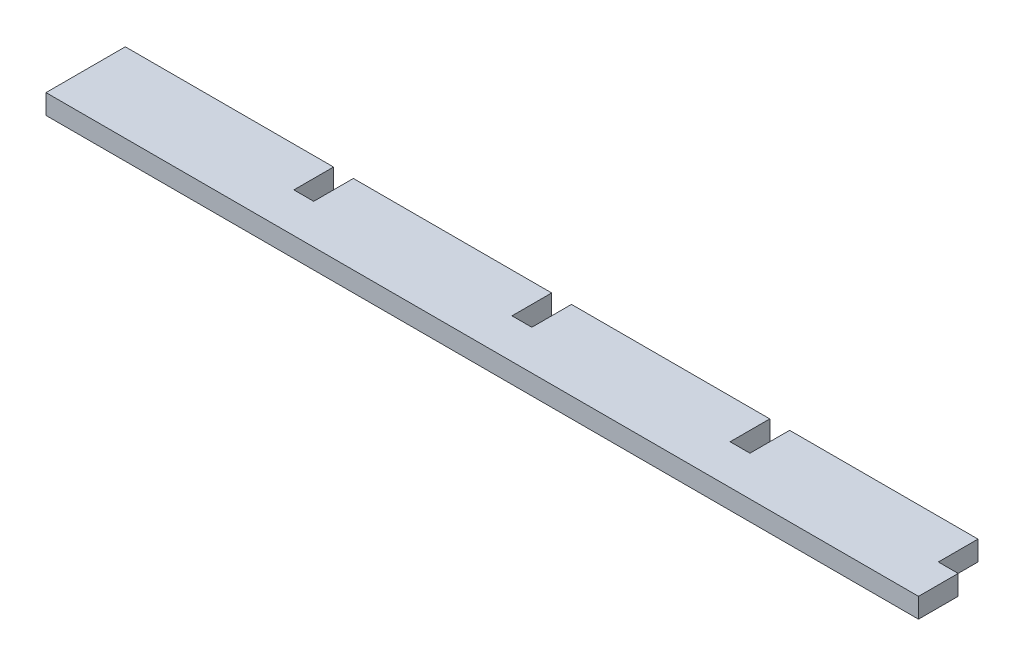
from build123d import *

# Parameters (mm, degrees)
SKETCH1_W           = 6.35
SKETCH1_H           = 12.7
BOSS_EXTRUDE2_DEPTH = 6.35


with BuildPart() as part:
    # Sketch1 → Boss-Extrude2 (new body)
    with BuildSketch(Plane(origin=(0, 0, 0), x_dir=(1, 0, 0), z_dir=(0, 1, 0))):
        Polygon((-279.4, 0), (-6.35, 0), (-6.35, 12.7), (-6.35, 25.4), (-66.675, 25.4), (-66.675, 12.7), (-73.025, 12.7), (-73.025, 25.4), (-136.525, 25.4), (-136.525, 12.7), (-142.875, 12.7), (-142.875, 25.4), (-206.375, 25.4), (-206.375, 12.7), (-212.725, 12.7), (-212.725, 25.4), (-279.4, 25.4), align=None)
        with Locations((-3.175, 6.35)):
            Rectangle(SKETCH1_W, SKETCH1_H)
    extrude(amount=BOSS_EXTRUDE2_DEPTH)


solid = part.part
